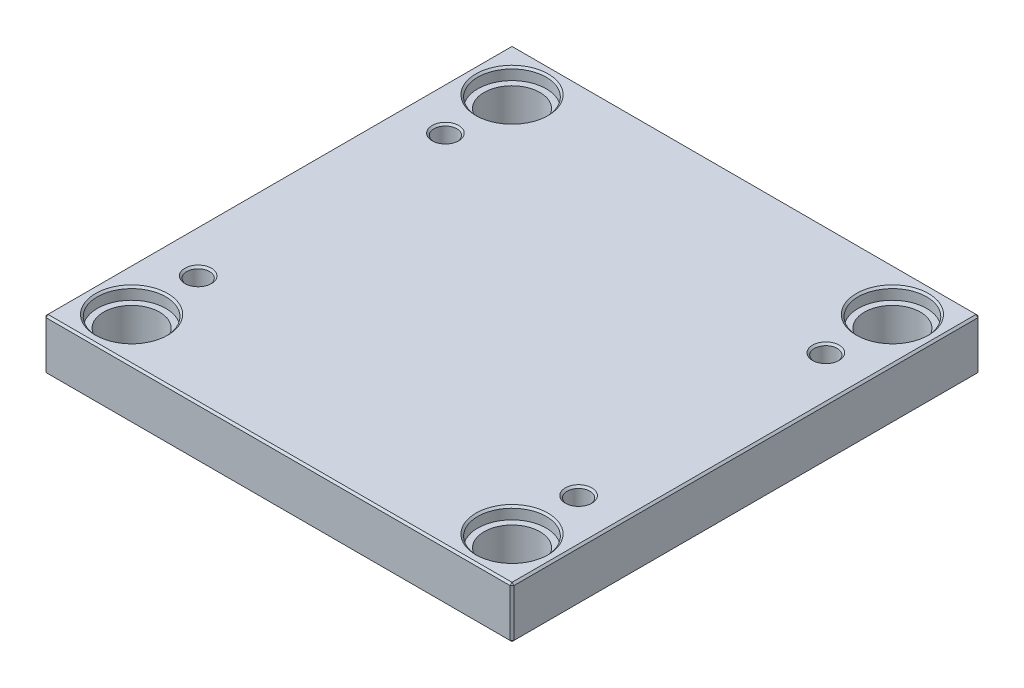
ISO-10303-21;
HEADER;
FILE_DESCRIPTION(('STEP AP214'),'2;1');
FILE_NAME('part.step','',(''),(''),'','','');
FILE_SCHEMA(('AUTOMOTIVE_DESIGN { 1 0 10303 214 1 1 1 1 }'));
ENDSEC;
DATA;
#1=APPLICATION_CONTEXT('core data for automotive mechanical design processes');
#2=APPLICATION_PROTOCOL_DEFINITION('international standard','automotive_design',2000,#1);
#3=PRODUCT_CONTEXT('',#1,'mechanical');
#4=PRODUCT('Part','Part','',(#3));
#5=PRODUCT_RELATED_PRODUCT_CATEGORY('part','',(#4));
#6=PRODUCT_DEFINITION_FORMATION('','',#4);
#7=PRODUCT_DEFINITION_CONTEXT('part definition',#1,'design');
#8=PRODUCT_DEFINITION('design','',#6,#7);
#9=PRODUCT_DEFINITION_SHAPE('','',#8);
#10=(LENGTH_UNIT() NAMED_UNIT(*) SI_UNIT(.MILLI.,.METRE.));
#11=(NAMED_UNIT(*) PLANE_ANGLE_UNIT() SI_UNIT($,.RADIAN.));
#12=(NAMED_UNIT(*) SI_UNIT($,.STERADIAN.) SOLID_ANGLE_UNIT());
#13=UNCERTAINTY_MEASURE_WITH_UNIT(LENGTH_MEASURE(1.E-05),#10,'distance_accuracy_value','');
#14=(GEOMETRIC_REPRESENTATION_CONTEXT(3) GLOBAL_UNCERTAINTY_ASSIGNED_CONTEXT((#13)) GLOBAL_UNIT_ASSIGNED_CONTEXT((#10,
#11,#12)) REPRESENTATION_CONTEXT('',''));
#15=CARTESIAN_POINT('',(0.,0.,0.));
#16=DIRECTION('',(0.,0.,1.));
#17=DIRECTION('',(1.,0.,0.));
#18=AXIS2_PLACEMENT_3D('',#15,#16,#17);
#19=CARTESIAN_POINT('',(-100.,0.,-100.));
#20=DIRECTION('',(0.,1.,0.));
#21=DIRECTION('',(0.,0.,1.));
#22=AXIS2_PLACEMENT_3D('',#19,#20,#21);
#23=CYLINDRICAL_SURFACE('',#22,14.7);
#24=CARTESIAN_POINT('',(-100.,1.00000000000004,-100.));
#25=DIRECTION('',(0.,1.,0.));
#26=DIRECTION('',(0.,0.,1.));
#27=AXIS2_PLACEMENT_3D('',#24,#25,#26);
#28=CIRCLE('',#27,14.7);
#29=CARTESIAN_POINT('',(-100.,1.00000000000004,-85.3));
#30=VERTEX_POINT('',#29);
#31=EDGE_CURVE('E471',#30,#30,#28,.F.);
#32=ORIENTED_EDGE('',*,*,#31,.T.);
#33=EDGE_LOOP('',(#32));
#34=FACE_BOUND('',#33,.T.);
#35=CARTESIAN_POINT('',(-100.,20.7,-100.));
#36=DIRECTION('',(0.,1.,0.));
#37=DIRECTION('',(0.,0.,1.));
#38=AXIS2_PLACEMENT_3D('',#35,#36,#37);
#39=CIRCLE('',#38,14.7);
#40=CARTESIAN_POINT('',(-100.,20.7,-85.3));
#41=VERTEX_POINT('',#40);
#42=EDGE_CURVE('E220',#41,#41,#39,.F.);
#43=ORIENTED_EDGE('',*,*,#42,.F.);
#44=EDGE_LOOP('',(#43));
#45=FACE_BOUND('',#44,.T.);
#46=ADVANCED_FACE('F15',(#34,#45),#23,.F.);
#47=CARTESIAN_POINT('',(100.,0.,-100.));
#48=DIRECTION('',(0.,1.,0.));
#49=DIRECTION('',(0.,0.,1.));
#50=AXIS2_PLACEMENT_3D('',#47,#48,#49);
#51=CYLINDRICAL_SURFACE('',#50,14.7);
#52=CARTESIAN_POINT('',(100.,1.00000000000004,-100.));
#53=DIRECTION('',(0.,1.,0.));
#54=DIRECTION('',(0.,0.,1.));
#55=AXIS2_PLACEMENT_3D('',#52,#53,#54);
#56=CIRCLE('',#55,14.7);
#57=CARTESIAN_POINT('',(100.,1.00000000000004,-85.3));
#58=VERTEX_POINT('',#57);
#59=EDGE_CURVE('E473',#58,#58,#56,.F.);
#60=ORIENTED_EDGE('',*,*,#59,.T.);
#61=EDGE_LOOP('',(#60));
#62=FACE_BOUND('',#61,.T.);
#63=CARTESIAN_POINT('',(100.,20.7,-100.));
#64=DIRECTION('',(0.,1.,0.));
#65=DIRECTION('',(0.,0.,1.));
#66=AXIS2_PLACEMENT_3D('',#63,#64,#65);
#67=CIRCLE('',#66,14.7);
#68=CARTESIAN_POINT('',(100.,20.7,-85.3));
#69=VERTEX_POINT('',#68);
#70=EDGE_CURVE('E217',#69,#69,#67,.F.);
#71=ORIENTED_EDGE('',*,*,#70,.F.);
#72=EDGE_LOOP('',(#71));
#73=FACE_BOUND('',#72,.T.);
#74=ADVANCED_FACE('F262',(#62,#73),#51,.F.);
#75=CARTESIAN_POINT('',(100.,0.,100.));
#76=DIRECTION('',(0.,1.,0.));
#77=DIRECTION('',(0.,0.,1.));
#78=AXIS2_PLACEMENT_3D('',#75,#76,#77);
#79=CYLINDRICAL_SURFACE('',#78,14.7);
#80=CARTESIAN_POINT('',(100.,0.999999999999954,100.));
#81=DIRECTION('',(0.,1.,0.));
#82=DIRECTION('',(0.,0.,1.));
#83=AXIS2_PLACEMENT_3D('',#80,#81,#82);
#84=CIRCLE('',#83,14.7);
#85=CARTESIAN_POINT('',(100.,0.999999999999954,114.7));
#86=VERTEX_POINT('',#85);
#87=EDGE_CURVE('E476',#86,#86,#84,.F.);
#88=ORIENTED_EDGE('',*,*,#87,.T.);
#89=EDGE_LOOP('',(#88));
#90=FACE_BOUND('',#89,.T.);
#91=CARTESIAN_POINT('',(100.,20.7,100.));
#92=DIRECTION('',(0.,1.,0.));
#93=DIRECTION('',(0.,0.,1.));
#94=AXIS2_PLACEMENT_3D('',#91,#92,#93);
#95=CIRCLE('',#94,14.7);
#96=CARTESIAN_POINT('',(100.,20.7,114.7));
#97=VERTEX_POINT('',#96);
#98=EDGE_CURVE('E213',#97,#97,#95,.F.);
#99=ORIENTED_EDGE('',*,*,#98,.F.);
#100=EDGE_LOOP('',(#99));
#101=FACE_BOUND('',#100,.T.);
#102=ADVANCED_FACE('F269',(#90,#101),#79,.F.);
#103=CARTESIAN_POINT('',(-100.,0.,100.));
#104=DIRECTION('',(0.,1.,0.));
#105=DIRECTION('',(0.,0.,1.));
#106=AXIS2_PLACEMENT_3D('',#103,#104,#105);
#107=CYLINDRICAL_SURFACE('',#106,14.7);
#108=CARTESIAN_POINT('',(-100.,1.00000000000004,100.));
#109=DIRECTION('',(0.,1.,0.));
#110=DIRECTION('',(0.,0.,1.));
#111=AXIS2_PLACEMENT_3D('',#108,#109,#110);
#112=CIRCLE('',#111,14.7);
#113=CARTESIAN_POINT('',(-100.,1.00000000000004,114.7));
#114=VERTEX_POINT('',#113);
#115=EDGE_CURVE('E479',#114,#114,#112,.F.);
#116=ORIENTED_EDGE('',*,*,#115,.T.);
#117=EDGE_LOOP('',(#116));
#118=FACE_BOUND('',#117,.T.);
#119=CARTESIAN_POINT('',(-100.,20.7,100.));
#120=DIRECTION('',(0.,1.,0.));
#121=DIRECTION('',(0.,0.,1.));
#122=AXIS2_PLACEMENT_3D('',#119,#120,#121);
#123=CIRCLE('',#122,14.7);
#124=CARTESIAN_POINT('',(-100.,20.7,114.7));
#125=VERTEX_POINT('',#124);
#126=EDGE_CURVE('E210',#125,#125,#123,.F.);
#127=ORIENTED_EDGE('',*,*,#126,.F.);
#128=EDGE_LOOP('',(#127));
#129=FACE_BOUND('',#128,.T.);
#130=ADVANCED_FACE('F276',(#118,#129),#107,.F.);
#131=CARTESIAN_POINT('',(-123.,27.,123.));
#132=DIRECTION('',(1.,0.,0.));
#133=DIRECTION('',(0.,0.,-1.));
#134=AXIS2_PLACEMENT_3D('',#131,#132,#133);
#135=PLANE('',#134);
#136=DIRECTION('',(0.,-1.,0.));
#137=VECTOR('',#136,1.);
#138=CARTESIAN_POINT('',(-123.,27.,-122.));
#139=LINE('',#138,#137);
#140=CARTESIAN_POINT('',(-123.,26.,-122.));
#141=VERTEX_POINT('',#140);
#142=CARTESIAN_POINT('',(-123.,0.999999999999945,-122.));
#143=VERTEX_POINT('',#142);
#144=EDGE_CURVE('E486',#141,#143,#139,.T.);
#145=ORIENTED_EDGE('',*,*,#144,.T.);
#146=DIRECTION('',(0.,0.,1.));
#147=VECTOR('',#146,1.);
#148=CARTESIAN_POINT('',(-123.,0.999999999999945,123.));
#149=LINE('',#148,#147);
#150=CARTESIAN_POINT('',(-123.,0.999999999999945,122.));
#151=VERTEX_POINT('',#150);
#152=EDGE_CURVE('E489',#143,#151,#149,.T.);
#153=ORIENTED_EDGE('',*,*,#152,.T.);
#154=DIRECTION('',(0.,1.,0.));
#155=VECTOR('',#154,1.);
#156=CARTESIAN_POINT('',(-123.,27.,122.));
#157=LINE('',#156,#155);
#158=CARTESIAN_POINT('',(-123.,26.,122.));
#159=VERTEX_POINT('',#158);
#160=EDGE_CURVE('E484',#151,#159,#157,.T.);
#161=ORIENTED_EDGE('',*,*,#160,.T.);
#162=DIRECTION('',(0.,0.,-1.));
#163=VECTOR('',#162,1.);
#164=CARTESIAN_POINT('',(-123.,26.,-123.));
#165=LINE('',#164,#163);
#166=EDGE_CURVE('E482',#159,#141,#165,.T.);
#167=ORIENTED_EDGE('',*,*,#166,.T.);
#168=EDGE_LOOP('',(#145,#153,#161,#167));
#169=FACE_BOUND('',#168,.T.);
#170=ADVANCED_FACE('F297',(#169),#135,.F.);
#171=CARTESIAN_POINT('',(123.,27.,123.));
#172=DIRECTION('',(0.,0.,-1.));
#173=DIRECTION('',(-1.,0.,0.));
#174=AXIS2_PLACEMENT_3D('',#171,#172,#173);
#175=PLANE('',#174);
#176=DIRECTION('',(-1.,0.,0.));
#177=VECTOR('',#176,1.);
#178=CARTESIAN_POINT('',(-123.,26.,123.));
#179=LINE('',#178,#177);
#180=CARTESIAN_POINT('',(122.,26.,123.));
#181=VERTEX_POINT('',#180);
#182=CARTESIAN_POINT('',(-122.,26.,123.));
#183=VERTEX_POINT('',#182);
#184=EDGE_CURVE('E508',#181,#183,#179,.T.);
#185=ORIENTED_EDGE('',*,*,#184,.T.);
#186=DIRECTION('',(0.,-1.,0.));
#187=VECTOR('',#186,1.);
#188=CARTESIAN_POINT('',(-122.,27.,123.));
#189=LINE('',#188,#187);
#190=CARTESIAN_POINT('',(-122.,0.999999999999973,123.));
#191=VERTEX_POINT('',#190);
#192=EDGE_CURVE('E514',#183,#191,#189,.T.);
#193=ORIENTED_EDGE('',*,*,#192,.T.);
#194=DIRECTION('',(1.,0.,0.));
#195=VECTOR('',#194,1.);
#196=CARTESIAN_POINT('',(123.,0.999999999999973,123.));
#197=LINE('',#196,#195);
#198=CARTESIAN_POINT('',(122.,0.999999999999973,123.));
#199=VERTEX_POINT('',#198);
#200=EDGE_CURVE('E512',#191,#199,#197,.T.);
#201=ORIENTED_EDGE('',*,*,#200,.T.);
#202=DIRECTION('',(0.,1.,0.));
#203=VECTOR('',#202,1.);
#204=CARTESIAN_POINT('',(122.,27.,123.));
#205=LINE('',#204,#203);
#206=EDGE_CURVE('E510',#199,#181,#205,.T.);
#207=ORIENTED_EDGE('',*,*,#206,.T.);
#208=EDGE_LOOP('',(#185,#193,#201,#207));
#209=FACE_BOUND('',#208,.T.);
#210=ADVANCED_FACE('F293',(#209),#175,.F.);
#211=CARTESIAN_POINT('',(123.,27.,123.));
#212=DIRECTION('',(-1.,0.,0.));
#213=DIRECTION('',(0.,0.,1.));
#214=AXIS2_PLACEMENT_3D('',#211,#212,#213);
#215=PLANE('',#214);
#216=DIRECTION('',(0.,0.,-1.));
#217=VECTOR('',#216,1.);
#218=CARTESIAN_POINT('',(123.,0.999999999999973,123.));
#219=LINE('',#218,#217);
#220=CARTESIAN_POINT('',(123.,0.999999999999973,122.));
#221=VERTEX_POINT('',#220);
#222=CARTESIAN_POINT('',(123.,0.999999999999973,-122.));
#223=VERTEX_POINT('',#222);
#224=EDGE_CURVE('E503',#221,#223,#219,.T.);
#225=ORIENTED_EDGE('',*,*,#224,.T.);
#226=DIRECTION('',(0.,1.,0.));
#227=VECTOR('',#226,1.);
#228=CARTESIAN_POINT('',(123.,27.,-122.));
#229=LINE('',#228,#227);
#230=CARTESIAN_POINT('',(123.,26.,-122.));
#231=VERTEX_POINT('',#230);
#232=EDGE_CURVE('E505',#223,#231,#229,.T.);
#233=ORIENTED_EDGE('',*,*,#232,.T.);
#234=DIRECTION('',(0.,0.,1.));
#235=VECTOR('',#234,1.);
#236=CARTESIAN_POINT('',(123.,26.,123.));
#237=LINE('',#236,#235);
#238=CARTESIAN_POINT('',(123.,26.,122.));
#239=VERTEX_POINT('',#238);
#240=EDGE_CURVE('E499',#231,#239,#237,.T.);
#241=ORIENTED_EDGE('',*,*,#240,.T.);
#242=DIRECTION('',(0.,-1.,0.));
#243=VECTOR('',#242,1.);
#244=CARTESIAN_POINT('',(123.,27.,122.));
#245=LINE('',#244,#243);
#246=EDGE_CURVE('E501',#239,#221,#245,.T.);
#247=ORIENTED_EDGE('',*,*,#246,.T.);
#248=EDGE_LOOP('',(#225,#233,#241,#247));
#249=FACE_BOUND('',#248,.T.);
#250=ADVANCED_FACE('F289',(#249),#215,.F.);
#251=CARTESIAN_POINT('',(123.,27.,-123.));
#252=DIRECTION('',(0.,0.,1.));
#253=DIRECTION('',(1.,0.,0.));
#254=AXIS2_PLACEMENT_3D('',#251,#252,#253);
#255=PLANE('',#254);
#256=DIRECTION('',(0.,-1.,0.));
#257=VECTOR('',#256,1.);
#258=CARTESIAN_POINT('',(122.,27.,-123.));
#259=LINE('',#258,#257);
#260=CARTESIAN_POINT('',(122.,26.,-123.));
#261=VERTEX_POINT('',#260);
#262=CARTESIAN_POINT('',(122.,0.999999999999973,-123.));
#263=VERTEX_POINT('',#262);
#264=EDGE_CURVE('E493',#261,#263,#259,.T.);
#265=ORIENTED_EDGE('',*,*,#264,.T.);
#266=DIRECTION('',(-1.,0.,0.));
#267=VECTOR('',#266,1.);
#268=CARTESIAN_POINT('',(123.,0.999999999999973,-123.));
#269=LINE('',#268,#267);
#270=CARTESIAN_POINT('',(-122.,0.999999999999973,-123.));
#271=VERTEX_POINT('',#270);
#272=EDGE_CURVE('E137',#263,#271,#269,.T.);
#273=ORIENTED_EDGE('',*,*,#272,.T.);
#274=DIRECTION('',(0.,1.,0.));
#275=VECTOR('',#274,1.);
#276=CARTESIAN_POINT('',(-122.,27.,-123.));
#277=LINE('',#276,#275);
#278=CARTESIAN_POINT('',(-122.,26.,-123.));
#279=VERTEX_POINT('',#278);
#280=EDGE_CURVE('E495',#271,#279,#277,.T.);
#281=ORIENTED_EDGE('',*,*,#280,.T.);
#282=DIRECTION('',(1.,0.,0.));
#283=VECTOR('',#282,1.);
#284=CARTESIAN_POINT('',(123.,26.,-123.));
#285=LINE('',#284,#283);
#286=EDGE_CURVE('E491',#279,#261,#285,.T.);
#287=ORIENTED_EDGE('',*,*,#286,.T.);
#288=EDGE_LOOP('',(#265,#273,#281,#287));
#289=FACE_BOUND('',#288,.T.);
#290=ADVANCED_FACE('F281',(#289),#255,.F.);
#291=CARTESIAN_POINT('',(0.,27.,0.));
#292=DIRECTION('',(0.,1.,0.));
#293=DIRECTION('',(0.,0.,1.));
#294=AXIS2_PLACEMENT_3D('',#291,#292,#293);
#295=PLANE('',#294);
#296=CARTESIAN_POINT('',(100.,27.,100.));
#297=DIRECTION('',(0.,1.,0.));
#298=DIRECTION('',(0.,0.,1.));
#299=AXIS2_PLACEMENT_3D('',#296,#297,#298);
#300=CIRCLE('',#299,19.);
#301=CARTESIAN_POINT('',(100.,27.,119.));
#302=VERTEX_POINT('',#301);
#303=EDGE_CURVE('E235',#302,#302,#300,.F.);
#304=ORIENTED_EDGE('',*,*,#303,.T.);
#305=EDGE_LOOP('',(#304));
#306=FACE_BOUND('',#305,.T.);
#307=CARTESIAN_POINT('',(-100.,27.,100.));
#308=DIRECTION('',(0.,1.,0.));
#309=DIRECTION('',(0.,0.,1.));
#310=AXIS2_PLACEMENT_3D('',#307,#308,#309);
#311=CIRCLE('',#310,19.);
#312=CARTESIAN_POINT('',(-100.,27.,119.));
#313=VERTEX_POINT('',#312);
#314=EDGE_CURVE('E232',#313,#313,#311,.F.);
#315=ORIENTED_EDGE('',*,*,#314,.T.);
#316=EDGE_LOOP('',(#315));
#317=FACE_BOUND('',#316,.T.);
#318=CARTESIAN_POINT('',(100.,27.,-100.));
#319=DIRECTION('',(0.,1.,0.));
#320=DIRECTION('',(0.,0.,1.));
#321=AXIS2_PLACEMENT_3D('',#318,#319,#320);
#322=CIRCLE('',#321,19.);
#323=CARTESIAN_POINT('',(100.,27.,-81.));
#324=VERTEX_POINT('',#323);
#325=EDGE_CURVE('E229',#324,#324,#322,.F.);
#326=ORIENTED_EDGE('',*,*,#325,.T.);
#327=EDGE_LOOP('',(#326));
#328=FACE_BOUND('',#327,.T.);
#329=CARTESIAN_POINT('',(-100.,27.,-100.));
#330=DIRECTION('',(0.,1.,0.));
#331=DIRECTION('',(0.,0.,1.));
#332=AXIS2_PLACEMENT_3D('',#329,#330,#331);
#333=CIRCLE('',#332,19.);
#334=CARTESIAN_POINT('',(-100.,27.,-81.));
#335=VERTEX_POINT('',#334);
#336=EDGE_CURVE('E226',#335,#335,#333,.F.);
#337=ORIENTED_EDGE('',*,*,#336,.T.);
#338=EDGE_LOOP('',(#337));
#339=FACE_BOUND('',#338,.T.);
#340=CARTESIAN_POINT('',(-100.,27.,65.));
#341=DIRECTION('',(0.,1.,0.));
#342=DIRECTION('',(0.,0.,1.));
#343=AXIS2_PLACEMENT_3D('',#340,#341,#342);
#344=CIRCLE('',#343,7.);
#345=CARTESIAN_POINT('',(-100.,27.,72.));
#346=VERTEX_POINT('',#345);
#347=EDGE_CURVE('E197',#346,#346,#344,.F.);
#348=ORIENTED_EDGE('',*,*,#347,.T.);
#349=EDGE_LOOP('',(#348));
#350=FACE_BOUND('',#349,.T.);
#351=CARTESIAN_POINT('',(100.,27.,65.));
#352=DIRECTION('',(0.,1.,0.));
#353=DIRECTION('',(0.,0.,1.));
#354=AXIS2_PLACEMENT_3D('',#351,#352,#353);
#355=CIRCLE('',#354,7.);
#356=CARTESIAN_POINT('',(100.,27.,72.));
#357=VERTEX_POINT('',#356);
#358=EDGE_CURVE('E194',#357,#357,#355,.F.);
#359=ORIENTED_EDGE('',*,*,#358,.T.);
#360=EDGE_LOOP('',(#359));
#361=FACE_BOUND('',#360,.T.);
#362=CARTESIAN_POINT('',(100.,27.,-65.));
#363=DIRECTION('',(0.,1.,0.));
#364=DIRECTION('',(0.,0.,1.));
#365=AXIS2_PLACEMENT_3D('',#362,#363,#364);
#366=CIRCLE('',#365,7.);
#367=CARTESIAN_POINT('',(100.,27.,-58.));
#368=VERTEX_POINT('',#367);
#369=EDGE_CURVE('E191',#368,#368,#366,.F.);
#370=ORIENTED_EDGE('',*,*,#369,.T.);
#371=EDGE_LOOP('',(#370));
#372=FACE_BOUND('',#371,.T.);
#373=CARTESIAN_POINT('',(-100.,27.,-65.));
#374=DIRECTION('',(0.,1.,0.));
#375=DIRECTION('',(0.,0.,1.));
#376=AXIS2_PLACEMENT_3D('',#373,#374,#375);
#377=CIRCLE('',#376,7.);
#378=CARTESIAN_POINT('',(-100.,27.,-58.));
#379=VERTEX_POINT('',#378);
#380=EDGE_CURVE('E187',#379,#379,#377,.F.);
#381=ORIENTED_EDGE('',*,*,#380,.T.);
#382=EDGE_LOOP('',(#381));
#383=FACE_BOUND('',#382,.T.);
#384=DIRECTION('',(0.,0.,-1.));
#385=VECTOR('',#384,1.);
#386=CARTESIAN_POINT('',(122.,27.,-123.));
#387=LINE('',#386,#385);
#388=CARTESIAN_POINT('',(122.,27.,122.));
#389=VERTEX_POINT('',#388);
#390=CARTESIAN_POINT('',(122.,27.,-122.));
#391=VERTEX_POINT('',#390);
#392=EDGE_CURVE('E30',#389,#391,#387,.T.);
#393=ORIENTED_EDGE('',*,*,#392,.T.);
#394=DIRECTION('',(-1.,0.,0.));
#395=VECTOR('',#394,1.);
#396=CARTESIAN_POINT('',(-123.,27.,-122.));
#397=LINE('',#396,#395);
#398=CARTESIAN_POINT('',(-122.,27.,-122.));
#399=VERTEX_POINT('',#398);
#400=EDGE_CURVE('E188',#391,#399,#397,.T.);
#401=ORIENTED_EDGE('',*,*,#400,.T.);
#402=DIRECTION('',(0.,0.,1.));
#403=VECTOR('',#402,1.);
#404=CARTESIAN_POINT('',(-122.,27.,123.));
#405=LINE('',#404,#403);
#406=CARTESIAN_POINT('',(-122.,27.,122.));
#407=VERTEX_POINT('',#406);
#408=EDGE_CURVE('E517',#399,#407,#405,.T.);
#409=ORIENTED_EDGE('',*,*,#408,.T.);
#410=DIRECTION('',(1.,0.,0.));
#411=VECTOR('',#410,1.);
#412=CARTESIAN_POINT('',(123.,27.,122.));
#413=LINE('',#412,#411);
#414=EDGE_CURVE('E35',#407,#389,#413,.T.);
#415=ORIENTED_EDGE('',*,*,#414,.T.);
#416=EDGE_LOOP('',(#393,#401,#409,#415));
#417=FACE_BOUND('',#416,.T.);
#418=ADVANCED_FACE('F278',(#306,#317,#328,#339,#350,#361,#372,#383,#417),#295,.T.);
#419=CARTESIAN_POINT('',(0.,0.,0.));
#420=DIRECTION('',(0.,1.,0.));
#421=DIRECTION('',(0.,0.,1.));
#422=AXIS2_PLACEMENT_3D('',#419,#420,#421);
#423=PLANE('',#422);
#424=CARTESIAN_POINT('',(-100.,0.,-100.));
#425=DIRECTION('',(0.,1.,0.));
#426=DIRECTION('',(0.,0.,1.));
#427=AXIS2_PLACEMENT_3D('',#424,#425,#426);
#428=CIRCLE('',#427,15.7);
#429=CARTESIAN_POINT('',(-100.,0.,-84.3));
#430=VERTEX_POINT('',#429);
#431=EDGE_CURVE('E468',#430,#430,#428,.T.);
#432=ORIENTED_EDGE('',*,*,#431,.T.);
#433=EDGE_LOOP('',(#432));
#434=FACE_BOUND('',#433,.T.);
#435=CARTESIAN_POINT('',(100.,0.,-100.));
#436=DIRECTION('',(0.,1.,0.));
#437=DIRECTION('',(0.,0.,1.));
#438=AXIS2_PLACEMENT_3D('',#435,#436,#437);
#439=CIRCLE('',#438,15.7);
#440=CARTESIAN_POINT('',(100.,0.,-84.3));
#441=VERTEX_POINT('',#440);
#442=EDGE_CURVE('E465',#441,#441,#439,.T.);
#443=ORIENTED_EDGE('',*,*,#442,.T.);
#444=EDGE_LOOP('',(#443));
#445=FACE_BOUND('',#444,.T.);
#446=CARTESIAN_POINT('',(100.,0.,100.));
#447=DIRECTION('',(0.,1.,0.));
#448=DIRECTION('',(0.,0.,1.));
#449=AXIS2_PLACEMENT_3D('',#446,#447,#448);
#450=CIRCLE('',#449,15.7);
#451=CARTESIAN_POINT('',(100.,0.,115.7));
#452=VERTEX_POINT('',#451);
#453=EDGE_CURVE('E462',#452,#452,#450,.T.);
#454=ORIENTED_EDGE('',*,*,#453,.T.);
#455=EDGE_LOOP('',(#454));
#456=FACE_BOUND('',#455,.T.);
#457=CARTESIAN_POINT('',(-100.,0.,100.));
#458=DIRECTION('',(0.,1.,0.));
#459=DIRECTION('',(0.,0.,1.));
#460=AXIS2_PLACEMENT_3D('',#457,#458,#459);
#461=CIRCLE('',#460,15.7);
#462=CARTESIAN_POINT('',(-100.,0.,115.7));
#463=VERTEX_POINT('',#462);
#464=EDGE_CURVE('E459',#463,#463,#461,.T.);
#465=ORIENTED_EDGE('',*,*,#464,.T.);
#466=EDGE_LOOP('',(#465));
#467=FACE_BOUND('',#466,.T.);
#468=DIRECTION('',(0.,0.,1.));
#469=VECTOR('',#468,1.);
#470=CARTESIAN_POINT('',(122.,0.,0.));
#471=LINE('',#470,#469);
#472=CARTESIAN_POINT('',(122.,0.,-122.));
#473=VERTEX_POINT('',#472);
#474=CARTESIAN_POINT('',(122.,0.,122.));
#475=VERTEX_POINT('',#474);
#476=EDGE_CURVE('E107',#473,#475,#471,.T.);
#477=ORIENTED_EDGE('',*,*,#476,.T.);
#478=DIRECTION('',(-1.,0.,0.));
#479=VECTOR('',#478,1.);
#480=CARTESIAN_POINT('',(0.,0.,122.));
#481=LINE('',#480,#479);
#482=CARTESIAN_POINT('',(-122.,0.,122.));
#483=VERTEX_POINT('',#482);
#484=EDGE_CURVE('E457',#475,#483,#481,.T.);
#485=ORIENTED_EDGE('',*,*,#484,.T.);
#486=DIRECTION('',(0.,0.,-1.));
#487=VECTOR('',#486,1.);
#488=CARTESIAN_POINT('',(-122.,0.,0.));
#489=LINE('',#488,#487);
#490=CARTESIAN_POINT('',(-122.,0.,-122.));
#491=VERTEX_POINT('',#490);
#492=EDGE_CURVE('E109',#483,#491,#489,.T.);
#493=ORIENTED_EDGE('',*,*,#492,.T.);
#494=DIRECTION('',(1.,0.,0.));
#495=VECTOR('',#494,1.);
#496=CARTESIAN_POINT('',(0.,0.,-122.));
#497=LINE('',#496,#495);
#498=EDGE_CURVE('E103',#491,#473,#497,.T.);
#499=ORIENTED_EDGE('',*,*,#498,.T.);
#500=EDGE_LOOP('',(#477,#485,#493,#499));
#501=FACE_BOUND('',#500,.T.);
#502=ADVANCED_FACE('F105',(#434,#445,#456,#467,#501),#423,.F.);
#503=CARTESIAN_POINT('',(-100.,0.,-100.));
#504=DIRECTION('',(0.,-1.,0.));
#505=DIRECTION('',(0.,0.,-1.));
#506=AXIS2_PLACEMENT_3D('',#503,#504,#505);
#507=CONICAL_SURFACE('',#506,15.7,0.785398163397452);
#508=ORIENTED_EDGE('',*,*,#31,.F.);
#509=EDGE_LOOP('',(#508));
#510=FACE_BOUND('',#509,.T.);
#511=ORIENTED_EDGE('',*,*,#431,.F.);
#512=EDGE_LOOP('',(#511));
#513=FACE_BOUND('',#512,.T.);
#514=ADVANCED_FACE('F285',(#510,#513),#507,.F.);
#515=CARTESIAN_POINT('',(100.,0.,-100.));
#516=DIRECTION('',(0.,-1.,0.));
#517=DIRECTION('',(0.,0.,-1.));
#518=AXIS2_PLACEMENT_3D('',#515,#516,#517);
#519=CONICAL_SURFACE('',#518,15.7,0.785398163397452);
#520=ORIENTED_EDGE('',*,*,#59,.F.);
#521=EDGE_LOOP('',(#520));
#522=FACE_BOUND('',#521,.T.);
#523=ORIENTED_EDGE('',*,*,#442,.F.);
#524=EDGE_LOOP('',(#523));
#525=FACE_BOUND('',#524,.T.);
#526=ADVANCED_FACE('F304',(#522,#525),#519,.F.);
#527=CARTESIAN_POINT('',(100.,0.,100.));
#528=DIRECTION('',(0.,-1.,0.));
#529=DIRECTION('',(0.,0.,-1.));
#530=AXIS2_PLACEMENT_3D('',#527,#528,#529);
#531=CONICAL_SURFACE('',#530,15.7,0.785398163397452);
#532=ORIENTED_EDGE('',*,*,#87,.F.);
#533=EDGE_LOOP('',(#532));
#534=FACE_BOUND('',#533,.T.);
#535=ORIENTED_EDGE('',*,*,#453,.F.);
#536=EDGE_LOOP('',(#535));
#537=FACE_BOUND('',#536,.T.);
#538=ADVANCED_FACE('F308',(#534,#537),#531,.F.);
#539=CARTESIAN_POINT('',(-100.,0.,100.));
#540=DIRECTION('',(0.,-1.,0.));
#541=DIRECTION('',(0.,0.,-1.));
#542=AXIS2_PLACEMENT_3D('',#539,#540,#541);
#543=CONICAL_SURFACE('',#542,15.7,0.785398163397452);
#544=ORIENTED_EDGE('',*,*,#115,.F.);
#545=EDGE_LOOP('',(#544));
#546=FACE_BOUND('',#545,.T.);
#547=ORIENTED_EDGE('',*,*,#464,.F.);
#548=EDGE_LOOP('',(#547));
#549=FACE_BOUND('',#548,.T.);
#550=ADVANCED_FACE('F312',(#546,#549),#543,.F.);
#551=CARTESIAN_POINT('',(123.,27.,122.));
#552=DIRECTION('',(-0.707106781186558,0.,-0.707106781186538));
#553=DIRECTION('',(0.,-1.,0.));
#554=AXIS2_PLACEMENT_3D('',#551,#552,#553);
#555=PLANE('',#554);
#556=DIRECTION('',(-0.707106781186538,0.,0.707106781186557));
#557=VECTOR('',#556,1.);
#558=CARTESIAN_POINT('',(122.,26.,123.));
#559=LINE('',#558,#557);
#560=EDGE_CURVE('E125',#181,#239,#559,.F.);
#561=ORIENTED_EDGE('',*,*,#560,.F.);
#562=ORIENTED_EDGE('',*,*,#206,.F.);
#563=DIRECTION('',(0.707106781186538,0.,-0.707106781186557));
#564=VECTOR('',#563,1.);
#565=CARTESIAN_POINT('',(122.,0.999999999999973,123.));
#566=LINE('',#565,#564);
#567=EDGE_CURVE('E179',#221,#199,#566,.F.);
#568=ORIENTED_EDGE('',*,*,#567,.F.);
#569=ORIENTED_EDGE('',*,*,#246,.F.);
#570=EDGE_LOOP('',(#561,#562,#568,#569));
#571=FACE_BOUND('',#570,.T.);
#572=ADVANCED_FACE('F316',(#571),#555,.F.);
#573=CARTESIAN_POINT('',(122.,26.,123.));
#574=DIRECTION('',(0.577350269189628,0.577350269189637,0.577350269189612));
#575=DIRECTION('',(-0.707106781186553,0.707106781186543,0.));
#576=AXIS2_PLACEMENT_3D('',#573,#574,#575);
#577=PLANE('',#576);
#578=DIRECTION('',(0.,-0.70710678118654,0.707106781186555));
#579=VECTOR('',#578,1.);
#580=CARTESIAN_POINT('',(122.,26.,123.));
#581=LINE('',#580,#579);
#582=EDGE_CURVE('E174',#181,#389,#581,.F.);
#583=ORIENTED_EDGE('',*,*,#582,.F.);
#584=ORIENTED_EDGE('',*,*,#560,.T.);
#585=DIRECTION('',(-0.707106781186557,0.707106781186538,0.));
#586=VECTOR('',#585,1.);
#587=CARTESIAN_POINT('',(122.5,26.5,122.));
#588=LINE('',#587,#586);
#589=EDGE_CURVE('E176',#389,#239,#588,.F.);
#590=ORIENTED_EDGE('',*,*,#589,.F.);
#591=EDGE_LOOP('',(#583,#584,#590));
#592=FACE_BOUND('',#591,.T.);
#593=ADVANCED_FACE('F384',(#592),#577,.T.);
#594=CARTESIAN_POINT('',(122.,0.999999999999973,123.));
#595=DIRECTION('',(0.577350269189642,-0.57735026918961,0.577350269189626));
#596=DIRECTION('',(0.707106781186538,0.,-0.707106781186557));
#597=AXIS2_PLACEMENT_3D('',#594,#595,#596);
#598=PLANE('',#597);
#599=DIRECTION('',(-0.707106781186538,-0.707106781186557,0.));
#600=VECTOR('',#599,1.);
#601=CARTESIAN_POINT('',(122.5,0.499999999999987,122.));
#602=LINE('',#601,#600);
#603=EDGE_CURVE('E123',#221,#475,#602,.T.);
#604=ORIENTED_EDGE('',*,*,#603,.F.);
#605=ORIENTED_EDGE('',*,*,#567,.T.);
#606=DIRECTION('',(0.,0.70710678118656,0.707106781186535));
#607=VECTOR('',#606,1.);
#608=CARTESIAN_POINT('',(122.,0.999999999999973,123.));
#609=LINE('',#608,#607);
#610=EDGE_CURVE('E171',#475,#199,#609,.T.);
#611=ORIENTED_EDGE('',*,*,#610,.F.);
#612=EDGE_LOOP('',(#604,#605,#611));
#613=FACE_BOUND('',#612,.T.);
#614=ADVANCED_FACE('F380',(#613),#598,.T.);
#615=CARTESIAN_POINT('',(122.,27.,0.));
#616=DIRECTION('',(0.707106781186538,0.707106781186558,0.));
#617=DIRECTION('',(0.,0.,1.));
#618=AXIS2_PLACEMENT_3D('',#615,#616,#617);
#619=PLANE('',#618);
#620=ORIENTED_EDGE('',*,*,#589,.T.);
#621=ORIENTED_EDGE('',*,*,#240,.F.);
#622=DIRECTION('',(0.707106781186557,-0.707106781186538,0.));
#623=VECTOR('',#622,1.);
#624=CARTESIAN_POINT('',(123.,26.,-122.));
#625=LINE('',#624,#623);
#626=EDGE_CURVE('E165',#391,#231,#625,.T.);
#627=ORIENTED_EDGE('',*,*,#626,.F.);
#628=ORIENTED_EDGE('',*,*,#392,.F.);
#629=EDGE_LOOP('',(#620,#621,#627,#628));
#630=FACE_BOUND('',#629,.T.);
#631=ADVANCED_FACE('F376',(#630),#619,.T.);
#632=CARTESIAN_POINT('',(0.,27.,122.));
#633=DIRECTION('',(0.,0.707106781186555,0.70710678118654));
#634=DIRECTION('',(-1.,0.,0.));
#635=AXIS2_PLACEMENT_3D('',#632,#633,#634);
#636=PLANE('',#635);
#637=ORIENTED_EDGE('',*,*,#582,.T.);
#638=ORIENTED_EDGE('',*,*,#414,.F.);
#639=DIRECTION('',(0.,0.70710678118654,-0.707106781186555));
#640=VECTOR('',#639,1.);
#641=CARTESIAN_POINT('',(-122.,26.5,122.5));
#642=LINE('',#641,#640);
#643=EDGE_CURVE('E162',#183,#407,#642,.T.);
#644=ORIENTED_EDGE('',*,*,#643,.F.);
#645=ORIENTED_EDGE('',*,*,#184,.F.);
#646=EDGE_LOOP('',(#637,#638,#644,#645));
#647=FACE_BOUND('',#646,.T.);
#648=ADVANCED_FACE('F372',(#647),#636,.T.);
#649=CARTESIAN_POINT('',(-122.,27.,123.));
#650=DIRECTION('',(0.707106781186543,0.,-0.707106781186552));
#651=DIRECTION('',(0.,-1.,0.));
#652=AXIS2_PLACEMENT_3D('',#649,#650,#651);
#653=PLANE('',#652);
#654=DIRECTION('',(0.707106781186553,0.,0.707106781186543));
#655=VECTOR('',#654,1.);
#656=CARTESIAN_POINT('',(-122.,0.999999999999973,123.));
#657=LINE('',#656,#655);
#658=EDGE_CURVE('E156',#191,#151,#657,.F.);
#659=ORIENTED_EDGE('',*,*,#658,.F.);
#660=ORIENTED_EDGE('',*,*,#192,.F.);
#661=DIRECTION('',(-0.707106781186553,0.,-0.707106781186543));
#662=VECTOR('',#661,1.);
#663=CARTESIAN_POINT('',(-123.,26.,122.));
#664=LINE('',#663,#662);
#665=EDGE_CURVE('E159',#159,#183,#664,.F.);
#666=ORIENTED_EDGE('',*,*,#665,.F.);
#667=ORIENTED_EDGE('',*,*,#160,.F.);
#668=EDGE_LOOP('',(#659,#660,#666,#667));
#669=FACE_BOUND('',#668,.T.);
#670=ADVANCED_FACE('F368',(#669),#653,.F.);
#671=CARTESIAN_POINT('',(123.,0.999999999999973,123.));
#672=DIRECTION('',(0.,0.707106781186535,-0.70710678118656));
#673=DIRECTION('',(1.,0.,0.));
#674=AXIS2_PLACEMENT_3D('',#671,#672,#673);
#675=PLANE('',#674);
#676=ORIENTED_EDGE('',*,*,#610,.T.);
#677=ORIENTED_EDGE('',*,*,#200,.F.);
#678=DIRECTION('',(0.,-0.70710678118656,-0.707106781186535));
#679=VECTOR('',#678,1.);
#680=CARTESIAN_POINT('',(-122.,0.999999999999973,123.));
#681=LINE('',#680,#679);
#682=EDGE_CURVE('E134',#483,#191,#681,.F.);
#683=ORIENTED_EDGE('',*,*,#682,.F.);
#684=ORIENTED_EDGE('',*,*,#484,.F.);
#685=EDGE_LOOP('',(#676,#677,#683,#684));
#686=FACE_BOUND('',#685,.T.);
#687=ADVANCED_FACE('F365',(#686),#675,.F.);
#688=CARTESIAN_POINT('',(123.,0.999999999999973,123.));
#689=DIRECTION('',(-0.707106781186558,0.707106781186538,0.));
#690=DIRECTION('',(0.,0.,-1.));
#691=AXIS2_PLACEMENT_3D('',#688,#689,#690);
#692=PLANE('',#691);
#693=ORIENTED_EDGE('',*,*,#603,.T.);
#694=ORIENTED_EDGE('',*,*,#476,.F.);
#695=DIRECTION('',(0.707106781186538,0.707106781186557,0.));
#696=VECTOR('',#695,1.);
#697=CARTESIAN_POINT('',(122.5,0.499999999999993,-122.));
#698=LINE('',#697,#696);
#699=EDGE_CURVE('E120',#223,#473,#698,.F.);
#700=ORIENTED_EDGE('',*,*,#699,.F.);
#701=ORIENTED_EDGE('',*,*,#224,.F.);
#702=EDGE_LOOP('',(#693,#694,#700,#701));
#703=FACE_BOUND('',#702,.T.);
#704=ADVANCED_FACE('F118',(#703),#692,.F.);
#705=CARTESIAN_POINT('',(122.,27.,-123.));
#706=DIRECTION('',(-0.707106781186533,0.,0.707106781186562));
#707=DIRECTION('',(0.,-1.,0.));
#708=AXIS2_PLACEMENT_3D('',#705,#706,#707);
#709=PLANE('',#708);
#710=DIRECTION('',(0.707106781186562,0.,0.707106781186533));
#711=VECTOR('',#710,1.);
#712=CARTESIAN_POINT('',(123.,26.,-122.));
#713=LINE('',#712,#711);
#714=EDGE_CURVE('E167',#231,#261,#713,.F.);
#715=ORIENTED_EDGE('',*,*,#714,.F.);
#716=ORIENTED_EDGE('',*,*,#232,.F.);
#717=DIRECTION('',(-0.707106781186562,0.,-0.707106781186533));
#718=VECTOR('',#717,1.);
#719=CARTESIAN_POINT('',(122.,0.999999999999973,-123.));
#720=LINE('',#719,#718);
#721=EDGE_CURVE('E133',#263,#223,#720,.F.);
#722=ORIENTED_EDGE('',*,*,#721,.F.);
#723=ORIENTED_EDGE('',*,*,#264,.F.);
#724=EDGE_LOOP('',(#715,#716,#722,#723));
#725=FACE_BOUND('',#724,.T.);
#726=ADVANCED_FACE('F358',(#725),#709,.F.);
#727=CARTESIAN_POINT('',(123.,26.,-122.));
#728=DIRECTION('',(0.577350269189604,0.577350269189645,-0.577350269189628));
#729=DIRECTION('',(0.,0.707106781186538,0.707106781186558));
#730=AXIS2_PLACEMENT_3D('',#727,#728,#729);
#731=PLANE('',#730);
#732=ORIENTED_EDGE('',*,*,#626,.T.);
#733=ORIENTED_EDGE('',*,*,#714,.T.);
#734=DIRECTION('',(0.,0.707106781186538,0.707106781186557));
#735=VECTOR('',#734,1.);
#736=CARTESIAN_POINT('',(122.,26.5,-122.5));
#737=LINE('',#736,#735);
#738=EDGE_CURVE('E151',#391,#261,#737,.F.);
#739=ORIENTED_EDGE('',*,*,#738,.F.);
#740=EDGE_LOOP('',(#732,#733,#739));
#741=FACE_BOUND('',#740,.T.);
#742=ADVANCED_FACE('F354',(#741),#731,.T.);
#743=CARTESIAN_POINT('',(-123.,26.,122.));
#744=DIRECTION('',(-0.577350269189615,0.577350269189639,0.577350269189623));
#745=DIRECTION('',(0.,-0.707106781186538,0.707106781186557));
#746=AXIS2_PLACEMENT_3D('',#743,#744,#745);
#747=PLANE('',#746);
#748=ORIENTED_EDGE('',*,*,#665,.T.);
#749=ORIENTED_EDGE('',*,*,#643,.T.);
#750=DIRECTION('',(-0.707106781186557,-0.707106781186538,0.));
#751=VECTOR('',#750,1.);
#752=CARTESIAN_POINT('',(-123.,26.,122.));
#753=LINE('',#752,#751);
#754=EDGE_CURVE('E142',#159,#407,#753,.F.);
#755=ORIENTED_EDGE('',*,*,#754,.F.);
#756=EDGE_LOOP('',(#748,#749,#755));
#757=FACE_BOUND('',#756,.T.);
#758=ADVANCED_FACE('F350',(#757),#747,.T.);
#759=CARTESIAN_POINT('',(-122.,0.999999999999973,123.));
#760=DIRECTION('',(-0.577350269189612,-0.577350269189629,0.577350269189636));
#761=DIRECTION('',(0.,-0.707106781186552,-0.707106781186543));
#762=AXIS2_PLACEMENT_3D('',#759,#760,#761);
#763=PLANE('',#762);
#764=ORIENTED_EDGE('',*,*,#682,.T.);
#765=ORIENTED_EDGE('',*,*,#658,.T.);
#766=DIRECTION('',(-0.707106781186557,0.707106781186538,0.));
#767=VECTOR('',#766,1.);
#768=CARTESIAN_POINT('',(-122.5,0.49999999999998,122.));
#769=LINE('',#768,#767);
#770=EDGE_CURVE('E138',#483,#151,#769,.T.);
#771=ORIENTED_EDGE('',*,*,#770,.F.);
#772=EDGE_LOOP('',(#764,#765,#771));
#773=FACE_BOUND('',#772,.T.);
#774=ADVANCED_FACE('F347',(#773),#763,.T.);
#775=CARTESIAN_POINT('',(122.,0.999999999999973,-123.));
#776=DIRECTION('',(0.577350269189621,-0.577350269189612,-0.577350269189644));
#777=DIRECTION('',(-0.707106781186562,0.,-0.707106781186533));
#778=AXIS2_PLACEMENT_3D('',#775,#776,#777);
#779=PLANE('',#778);
#780=ORIENTED_EDGE('',*,*,#721,.T.);
#781=ORIENTED_EDGE('',*,*,#699,.T.);
#782=DIRECTION('',(0.,-0.707106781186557,0.707106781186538));
#783=VECTOR('',#782,1.);
#784=CARTESIAN_POINT('',(122.,0.999999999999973,-123.));
#785=LINE('',#784,#783);
#786=EDGE_CURVE('E130',#263,#473,#785,.T.);
#787=ORIENTED_EDGE('',*,*,#786,.F.);
#788=EDGE_LOOP('',(#780,#781,#787));
#789=FACE_BOUND('',#788,.T.);
#790=ADVANCED_FACE('F129',(#789),#779,.T.);
#791=CARTESIAN_POINT('',(0.,27.,-122.));
#792=DIRECTION('',(0.,0.707106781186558,-0.707106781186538));
#793=DIRECTION('',(1.,0.,0.));
#794=AXIS2_PLACEMENT_3D('',#791,#792,#793);
#795=PLANE('',#794);
#796=ORIENTED_EDGE('',*,*,#738,.T.);
#797=ORIENTED_EDGE('',*,*,#286,.F.);
#798=DIRECTION('',(0.,-0.707106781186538,-0.707106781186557));
#799=VECTOR('',#798,1.);
#800=CARTESIAN_POINT('',(-122.,26.,-123.));
#801=LINE('',#800,#799);
#802=EDGE_CURVE('E139',#399,#279,#801,.T.);
#803=ORIENTED_EDGE('',*,*,#802,.F.);
#804=ORIENTED_EDGE('',*,*,#400,.F.);
#805=EDGE_LOOP('',(#796,#797,#803,#804));
#806=FACE_BOUND('',#805,.T.);
#807=ADVANCED_FACE('F340',(#806),#795,.T.);
#808=CARTESIAN_POINT('',(-122.,27.,0.));
#809=DIRECTION('',(-0.707106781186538,0.707106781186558,0.));
#810=DIRECTION('',(0.,0.,-1.));
#811=AXIS2_PLACEMENT_3D('',#808,#809,#810);
#812=PLANE('',#811);
#813=ORIENTED_EDGE('',*,*,#754,.T.);
#814=ORIENTED_EDGE('',*,*,#408,.F.);
#815=DIRECTION('',(0.707106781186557,0.707106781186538,0.));
#816=VECTOR('',#815,1.);
#817=CARTESIAN_POINT('',(-122.5,26.5,-122.));
#818=LINE('',#817,#816);
#819=EDGE_CURVE('E145',#141,#399,#818,.T.);
#820=ORIENTED_EDGE('',*,*,#819,.F.);
#821=ORIENTED_EDGE('',*,*,#166,.F.);
#822=EDGE_LOOP('',(#813,#814,#820,#821));
#823=FACE_BOUND('',#822,.T.);
#824=ADVANCED_FACE('F336',(#823),#812,.T.);
#825=CARTESIAN_POINT('',(-123.,0.999999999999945,123.));
#826=DIRECTION('',(0.707106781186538,0.707106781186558,0.));
#827=DIRECTION('',(0.,0.,1.));
#828=AXIS2_PLACEMENT_3D('',#825,#826,#827);
#829=PLANE('',#828);
#830=ORIENTED_EDGE('',*,*,#770,.T.);
#831=ORIENTED_EDGE('',*,*,#152,.F.);
#832=DIRECTION('',(0.707106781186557,-0.707106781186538,0.));
#833=VECTOR('',#832,1.);
#834=CARTESIAN_POINT('',(-123.,0.999999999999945,-122.));
#835=LINE('',#834,#833);
#836=EDGE_CURVE('E528',#491,#143,#835,.F.);
#837=ORIENTED_EDGE('',*,*,#836,.F.);
#838=ORIENTED_EDGE('',*,*,#492,.F.);
#839=EDGE_LOOP('',(#830,#831,#837,#838));
#840=FACE_BOUND('',#839,.T.);
#841=ADVANCED_FACE('F333',(#840),#829,.F.);
#842=CARTESIAN_POINT('',(123.,0.999999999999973,-123.));
#843=DIRECTION('',(0.,0.707106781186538,0.707106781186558));
#844=DIRECTION('',(-1.,0.,0.));
#845=AXIS2_PLACEMENT_3D('',#842,#843,#844);
#846=PLANE('',#845);
#847=ORIENTED_EDGE('',*,*,#786,.T.);
#848=ORIENTED_EDGE('',*,*,#498,.F.);
#849=DIRECTION('',(0.,0.707106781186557,-0.707106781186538));
#850=VECTOR('',#849,1.);
#851=CARTESIAN_POINT('',(-122.,0.499999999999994,-122.5));
#852=LINE('',#851,#850);
#853=EDGE_CURVE('E525',#271,#491,#852,.F.);
#854=ORIENTED_EDGE('',*,*,#853,.F.);
#855=ORIENTED_EDGE('',*,*,#272,.F.);
#856=EDGE_LOOP('',(#847,#848,#854,#855));
#857=FACE_BOUND('',#856,.T.);
#858=ADVANCED_FACE('F136',(#857),#846,.F.);
#859=CARTESIAN_POINT('',(-122.,26.,-123.));
#860=DIRECTION('',(-0.577350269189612,0.577350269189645,-0.577350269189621));
#861=DIRECTION('',(0.,0.707106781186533,0.707106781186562));
#862=AXIS2_PLACEMENT_3D('',#859,#860,#861);
#863=PLANE('',#862);
#864=ORIENTED_EDGE('',*,*,#819,.T.);
#865=ORIENTED_EDGE('',*,*,#802,.T.);
#866=DIRECTION('',(0.707106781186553,0.,-0.707106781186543));
#867=VECTOR('',#866,1.);
#868=CARTESIAN_POINT('',(-122.,26.,-123.));
#869=LINE('',#868,#867);
#870=EDGE_CURVE('E523',#141,#279,#869,.T.);
#871=ORIENTED_EDGE('',*,*,#870,.F.);
#872=EDGE_LOOP('',(#864,#865,#871));
#873=FACE_BOUND('',#872,.T.);
#874=ADVANCED_FACE('F326',(#873),#863,.T.);
#875=CARTESIAN_POINT('',(-123.,0.999999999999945,-122.));
#876=DIRECTION('',(-0.577350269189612,-0.577350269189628,-0.577350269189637));
#877=DIRECTION('',(0.,0.707106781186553,-0.707106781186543));
#878=AXIS2_PLACEMENT_3D('',#875,#876,#877);
#879=PLANE('',#878);
#880=ORIENTED_EDGE('',*,*,#853,.T.);
#881=ORIENTED_EDGE('',*,*,#836,.T.);
#882=DIRECTION('',(-0.707106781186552,0.,0.707106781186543));
#883=VECTOR('',#882,1.);
#884=CARTESIAN_POINT('',(-123.,0.999999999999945,-122.));
#885=LINE('',#884,#883);
#886=EDGE_CURVE('E454',#271,#143,#885,.T.);
#887=ORIENTED_EDGE('',*,*,#886,.F.);
#888=EDGE_LOOP('',(#880,#881,#887));
#889=FACE_BOUND('',#888,.T.);
#890=ADVANCED_FACE('F322',(#889),#879,.T.);
#891=CARTESIAN_POINT('',(-123.,27.,-122.));
#892=DIRECTION('',(0.707106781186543,0.,0.707106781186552));
#893=DIRECTION('',(0.,-1.,0.));
#894=AXIS2_PLACEMENT_3D('',#891,#892,#893);
#895=PLANE('',#894);
#896=ORIENTED_EDGE('',*,*,#870,.T.);
#897=ORIENTED_EDGE('',*,*,#280,.F.);
#898=ORIENTED_EDGE('',*,*,#886,.T.);
#899=ORIENTED_EDGE('',*,*,#144,.F.);
#900=EDGE_LOOP('',(#896,#897,#898,#899));
#901=FACE_BOUND('',#900,.T.);
#902=ADVANCED_FACE('F318',(#901),#895,.F.);
#903=CARTESIAN_POINT('',(-100.,5.,-65.));
#904=DIRECTION('',(0.,1.,0.));
#905=DIRECTION('',(0.,0.,1.));
#906=AXIS2_PLACEMENT_3D('',#903,#904,#905);
#907=CYLINDRICAL_SURFACE('',#906,6.);
#908=CARTESIAN_POINT('',(-100.,26.,-65.));
#909=DIRECTION('',(0.,1.,0.));
#910=DIRECTION('',(0.,0.,1.));
#911=AXIS2_PLACEMENT_3D('',#908,#909,#910);
#912=CIRCLE('',#911,6.);
#913=CARTESIAN_POINT('',(-100.,26.,-59.));
#914=VERTEX_POINT('',#913);
#915=EDGE_CURVE('E206',#914,#914,#912,.T.);
#916=ORIENTED_EDGE('',*,*,#915,.T.);
#917=EDGE_LOOP('',(#916));
#918=FACE_BOUND('',#917,.T.);
#919=CARTESIAN_POINT('',(-100.,5.,-65.));
#920=DIRECTION('',(0.,1.,0.));
#921=DIRECTION('',(0.,0.,1.));
#922=AXIS2_PLACEMENT_3D('',#919,#920,#921);
#923=CIRCLE('',#922,6.);
#924=CARTESIAN_POINT('',(-100.,5.,-59.));
#925=VERTEX_POINT('',#924);
#926=EDGE_CURVE('E447',#925,#925,#923,.T.);
#927=ORIENTED_EDGE('',*,*,#926,.F.);
#928=EDGE_LOOP('',(#927));
#929=FACE_BOUND('',#928,.T.);
#930=ADVANCED_FACE('F321',(#918,#929),#907,.F.);
#931=CARTESIAN_POINT('',(-100.,5.,-65.));
#932=DIRECTION('',(0.,1.,0.));
#933=DIRECTION('',(0.,0.,1.));
#934=AXIS2_PLACEMENT_3D('',#931,#932,#933);
#935=PLANE('',#934);
#936=ORIENTED_EDGE('',*,*,#926,.T.);
#937=EDGE_LOOP('',(#936));
#938=FACE_BOUND('',#937,.T.);
#939=ADVANCED_FACE('F595',(#938),#935,.T.);
#940=CARTESIAN_POINT('',(100.,5.,-65.));
#941=DIRECTION('',(0.,1.,0.));
#942=DIRECTION('',(0.,0.,1.));
#943=AXIS2_PLACEMENT_3D('',#940,#941,#942);
#944=CYLINDRICAL_SURFACE('',#943,6.);
#945=CARTESIAN_POINT('',(100.,26.,-65.));
#946=DIRECTION('',(0.,1.,0.));
#947=DIRECTION('',(0.,0.,1.));
#948=AXIS2_PLACEMENT_3D('',#945,#946,#947);
#949=CIRCLE('',#948,6.);
#950=CARTESIAN_POINT('',(100.,26.,-59.));
#951=VERTEX_POINT('',#950);
#952=EDGE_CURVE('E203',#951,#951,#949,.T.);
#953=ORIENTED_EDGE('',*,*,#952,.T.);
#954=EDGE_LOOP('',(#953));
#955=FACE_BOUND('',#954,.T.);
#956=CARTESIAN_POINT('',(100.,5.,-65.));
#957=DIRECTION('',(0.,1.,0.));
#958=DIRECTION('',(0.,0.,1.));
#959=AXIS2_PLACEMENT_3D('',#956,#957,#958);
#960=CIRCLE('',#959,6.);
#961=CARTESIAN_POINT('',(100.,5.,-59.));
#962=VERTEX_POINT('',#961);
#963=EDGE_CURVE('E444',#962,#962,#960,.T.);
#964=ORIENTED_EDGE('',*,*,#963,.F.);
#965=EDGE_LOOP('',(#964));
#966=FACE_BOUND('',#965,.T.);
#967=ADVANCED_FACE('F591',(#955,#966),#944,.F.);
#968=CARTESIAN_POINT('',(100.,5.,-65.));
#969=DIRECTION('',(0.,1.,0.));
#970=DIRECTION('',(0.,0.,1.));
#971=AXIS2_PLACEMENT_3D('',#968,#969,#970);
#972=PLANE('',#971);
#973=ORIENTED_EDGE('',*,*,#963,.T.);
#974=EDGE_LOOP('',(#973));
#975=FACE_BOUND('',#974,.T.);
#976=ADVANCED_FACE('F587',(#975),#972,.T.);
#977=CARTESIAN_POINT('',(100.,5.,65.));
#978=DIRECTION('',(0.,1.,0.));
#979=DIRECTION('',(0.,0.,1.));
#980=AXIS2_PLACEMENT_3D('',#977,#978,#979);
#981=CYLINDRICAL_SURFACE('',#980,6.);
#982=CARTESIAN_POINT('',(100.,26.,65.));
#983=DIRECTION('',(0.,1.,0.));
#984=DIRECTION('',(0.,0.,1.));
#985=AXIS2_PLACEMENT_3D('',#982,#983,#984);
#986=CIRCLE('',#985,6.);
#987=CARTESIAN_POINT('',(100.,26.,71.));
#988=VERTEX_POINT('',#987);
#989=EDGE_CURVE('E200',#988,#988,#986,.T.);
#990=ORIENTED_EDGE('',*,*,#989,.T.);
#991=EDGE_LOOP('',(#990));
#992=FACE_BOUND('',#991,.T.);
#993=CARTESIAN_POINT('',(100.,5.,65.));
#994=DIRECTION('',(0.,1.,0.));
#995=DIRECTION('',(0.,0.,1.));
#996=AXIS2_PLACEMENT_3D('',#993,#994,#995);
#997=CIRCLE('',#996,6.);
#998=CARTESIAN_POINT('',(100.,5.,71.));
#999=VERTEX_POINT('',#998);
#1000=EDGE_CURVE('E448',#999,#999,#997,.T.);
#1001=ORIENTED_EDGE('',*,*,#1000,.F.);
#1002=EDGE_LOOP('',(#1001));
#1003=FACE_BOUND('',#1002,.T.);
#1004=ADVANCED_FACE('F590',(#992,#1003),#981,.F.);
#1005=CARTESIAN_POINT('',(100.,5.,65.));
#1006=DIRECTION('',(0.,1.,0.));
#1007=DIRECTION('',(0.,0.,1.));
#1008=AXIS2_PLACEMENT_3D('',#1005,#1006,#1007);
#1009=PLANE('',#1008);
#1010=ORIENTED_EDGE('',*,*,#1000,.T.);
#1011=EDGE_LOOP('',(#1010));
#1012=FACE_BOUND('',#1011,.T.);
#1013=ADVANCED_FACE('F597',(#1012),#1009,.T.);
#1014=CARTESIAN_POINT('',(-100.,5.,65.));
#1015=DIRECTION('',(0.,1.,0.));
#1016=DIRECTION('',(0.,0.,1.));
#1017=AXIS2_PLACEMENT_3D('',#1014,#1015,#1016);
#1018=CYLINDRICAL_SURFACE('',#1017,6.);
#1019=CARTESIAN_POINT('',(-100.,26.,65.));
#1020=DIRECTION('',(0.,1.,0.));
#1021=DIRECTION('',(0.,0.,1.));
#1022=AXIS2_PLACEMENT_3D('',#1019,#1020,#1021);
#1023=CIRCLE('',#1022,6.);
#1024=CARTESIAN_POINT('',(-100.,26.,71.));
#1025=VERTEX_POINT('',#1024);
#1026=EDGE_CURVE('E184',#1025,#1025,#1023,.T.);
#1027=ORIENTED_EDGE('',*,*,#1026,.T.);
#1028=EDGE_LOOP('',(#1027));
#1029=FACE_BOUND('',#1028,.T.);
#1030=CARTESIAN_POINT('',(-100.,5.,65.));
#1031=DIRECTION('',(0.,1.,0.));
#1032=DIRECTION('',(0.,0.,1.));
#1033=AXIS2_PLACEMENT_3D('',#1030,#1031,#1032);
#1034=CIRCLE('',#1033,6.);
#1035=CARTESIAN_POINT('',(-100.,5.,71.));
#1036=VERTEX_POINT('',#1035);
#1037=EDGE_CURVE('E223',#1036,#1036,#1034,.T.);
#1038=ORIENTED_EDGE('',*,*,#1037,.F.);
#1039=EDGE_LOOP('',(#1038));
#1040=FACE_BOUND('',#1039,.T.);
#1041=ADVANCED_FACE('F600',(#1029,#1040),#1018,.F.);
#1042=CARTESIAN_POINT('',(-100.,5.,65.));
#1043=DIRECTION('',(0.,1.,0.));
#1044=DIRECTION('',(0.,0.,1.));
#1045=AXIS2_PLACEMENT_3D('',#1042,#1043,#1044);
#1046=PLANE('',#1045);
#1047=ORIENTED_EDGE('',*,*,#1037,.T.);
#1048=EDGE_LOOP('',(#1047));
#1049=FACE_BOUND('',#1048,.T.);
#1050=ADVANCED_FACE('F396',(#1049),#1046,.T.);
#1051=CARTESIAN_POINT('',(-100.,26.,65.));
#1052=DIRECTION('',(0.,1.,0.));
#1053=DIRECTION('',(0.,0.,1.));
#1054=AXIS2_PLACEMENT_3D('',#1051,#1052,#1053);
#1055=CONICAL_SURFACE('',#1054,6.,0.785398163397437);
#1056=ORIENTED_EDGE('',*,*,#347,.F.);
#1057=EDGE_LOOP('',(#1056));
#1058=FACE_BOUND('',#1057,.T.);
#1059=ORIENTED_EDGE('',*,*,#1026,.F.);
#1060=EDGE_LOOP('',(#1059));
#1061=FACE_BOUND('',#1060,.T.);
#1062=ADVANCED_FACE('F392',(#1058,#1061),#1055,.F.);
#1063=CARTESIAN_POINT('',(100.,26.,65.));
#1064=DIRECTION('',(0.,1.,0.));
#1065=DIRECTION('',(0.,0.,1.));
#1066=AXIS2_PLACEMENT_3D('',#1063,#1064,#1065);
#1067=CONICAL_SURFACE('',#1066,6.,0.785398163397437);
#1068=ORIENTED_EDGE('',*,*,#358,.F.);
#1069=EDGE_LOOP('',(#1068));
#1070=FACE_BOUND('',#1069,.T.);
#1071=ORIENTED_EDGE('',*,*,#989,.F.);
#1072=EDGE_LOOP('',(#1071));
#1073=FACE_BOUND('',#1072,.T.);
#1074=ADVANCED_FACE('F395',(#1070,#1073),#1067,.F.);
#1075=CARTESIAN_POINT('',(100.,26.,-65.));
#1076=DIRECTION('',(0.,1.,0.));
#1077=DIRECTION('',(0.,0.,1.));
#1078=AXIS2_PLACEMENT_3D('',#1075,#1076,#1077);
#1079=CONICAL_SURFACE('',#1078,6.,0.785398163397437);
#1080=ORIENTED_EDGE('',*,*,#369,.F.);
#1081=EDGE_LOOP('',(#1080));
#1082=FACE_BOUND('',#1081,.T.);
#1083=ORIENTED_EDGE('',*,*,#952,.F.);
#1084=EDGE_LOOP('',(#1083));
#1085=FACE_BOUND('',#1084,.T.);
#1086=ADVANCED_FACE('F400',(#1082,#1085),#1079,.F.);
#1087=CARTESIAN_POINT('',(-100.,26.,-65.));
#1088=DIRECTION('',(0.,1.,0.));
#1089=DIRECTION('',(0.,0.,1.));
#1090=AXIS2_PLACEMENT_3D('',#1087,#1088,#1089);
#1091=CONICAL_SURFACE('',#1090,6.,0.785398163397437);
#1092=ORIENTED_EDGE('',*,*,#380,.F.);
#1093=EDGE_LOOP('',(#1092));
#1094=FACE_BOUND('',#1093,.T.);
#1095=ORIENTED_EDGE('',*,*,#915,.F.);
#1096=EDGE_LOOP('',(#1095));
#1097=FACE_BOUND('',#1096,.T.);
#1098=ADVANCED_FACE('F404',(#1094,#1097),#1091,.F.);
#1099=CARTESIAN_POINT('',(-100.,20.7,100.));
#1100=DIRECTION('',(0.,1.,0.));
#1101=DIRECTION('',(0.,0.,1.));
#1102=AXIS2_PLACEMENT_3D('',#1099,#1100,#1101);
#1103=PLANE('',#1102);
#1104=CARTESIAN_POINT('',(-100.,20.7,100.));
#1105=DIRECTION('',(0.,1.,0.));
#1106=DIRECTION('',(0.,0.,1.));
#1107=AXIS2_PLACEMENT_3D('',#1104,#1105,#1106);
#1108=CIRCLE('',#1107,18.);
#1109=CARTESIAN_POINT('',(-100.,20.7,118.));
#1110=VERTEX_POINT('',#1109);
#1111=EDGE_CURVE('E435',#1110,#1110,#1108,.T.);
#1112=ORIENTED_EDGE('',*,*,#1111,.T.);
#1113=EDGE_LOOP('',(#1112));
#1114=FACE_BOUND('',#1113,.T.);
#1115=ORIENTED_EDGE('',*,*,#126,.T.);
#1116=EDGE_LOOP('',(#1115));
#1117=FACE_BOUND('',#1116,.T.);
#1118=ADVANCED_FACE('F408',(#1114,#1117),#1103,.T.);
#1119=CARTESIAN_POINT('',(-100.,20.7,100.));
#1120=DIRECTION('',(0.,1.,0.));
#1121=DIRECTION('',(0.,0.,1.));
#1122=AXIS2_PLACEMENT_3D('',#1119,#1120,#1121);
#1123=CYLINDRICAL_SURFACE('',#1122,18.);
#1124=CARTESIAN_POINT('',(-100.,26.,100.));
#1125=DIRECTION('',(0.,1.,0.));
#1126=DIRECTION('',(0.,0.,1.));
#1127=AXIS2_PLACEMENT_3D('',#1124,#1125,#1126);
#1128=CIRCLE('',#1127,18.);
#1129=CARTESIAN_POINT('',(-100.,26.,118.));
#1130=VERTEX_POINT('',#1129);
#1131=EDGE_CURVE('E238',#1130,#1130,#1128,.T.);
#1132=ORIENTED_EDGE('',*,*,#1131,.T.);
#1133=EDGE_LOOP('',(#1132));
#1134=FACE_BOUND('',#1133,.T.);
#1135=ORIENTED_EDGE('',*,*,#1111,.F.);
#1136=EDGE_LOOP('',(#1135));
#1137=FACE_BOUND('',#1136,.T.);
#1138=ADVANCED_FACE('F573',(#1134,#1137),#1123,.F.);
#1139=CARTESIAN_POINT('',(100.,20.7,100.));
#1140=DIRECTION('',(0.,1.,0.));
#1141=DIRECTION('',(0.,0.,1.));
#1142=AXIS2_PLACEMENT_3D('',#1139,#1140,#1141);
#1143=PLANE('',#1142);
#1144=CARTESIAN_POINT('',(100.,20.7,100.));
#1145=DIRECTION('',(0.,1.,0.));
#1146=DIRECTION('',(0.,0.,1.));
#1147=AXIS2_PLACEMENT_3D('',#1144,#1145,#1146);
#1148=CIRCLE('',#1147,18.);
#1149=CARTESIAN_POINT('',(100.,20.7,118.));
#1150=VERTEX_POINT('',#1149);
#1151=EDGE_CURVE('E432',#1150,#1150,#1148,.T.);
#1152=ORIENTED_EDGE('',*,*,#1151,.T.);
#1153=EDGE_LOOP('',(#1152));
#1154=FACE_BOUND('',#1153,.T.);
#1155=ORIENTED_EDGE('',*,*,#98,.T.);
#1156=EDGE_LOOP('',(#1155));
#1157=FACE_BOUND('',#1156,.T.);
#1158=ADVANCED_FACE('F428',(#1154,#1157),#1143,.T.);
#1159=CARTESIAN_POINT('',(100.,20.7,100.));
#1160=DIRECTION('',(0.,1.,0.));
#1161=DIRECTION('',(0.,0.,1.));
#1162=AXIS2_PLACEMENT_3D('',#1159,#1160,#1161);
#1163=CYLINDRICAL_SURFACE('',#1162,18.);
#1164=CARTESIAN_POINT('',(100.,26.,100.));
#1165=DIRECTION('',(0.,1.,0.));
#1166=DIRECTION('',(0.,0.,1.));
#1167=AXIS2_PLACEMENT_3D('',#1164,#1165,#1166);
#1168=CIRCLE('',#1167,18.);
#1169=CARTESIAN_POINT('',(100.,26.,118.));
#1170=VERTEX_POINT('',#1169);
#1171=EDGE_CURVE('E209',#1170,#1170,#1168,.T.);
#1172=ORIENTED_EDGE('',*,*,#1171,.T.);
#1173=EDGE_LOOP('',(#1172));
#1174=FACE_BOUND('',#1173,.T.);
#1175=ORIENTED_EDGE('',*,*,#1151,.F.);
#1176=EDGE_LOOP('',(#1175));
#1177=FACE_BOUND('',#1176,.T.);
#1178=ADVANCED_FACE('F424',(#1174,#1177),#1163,.F.);
#1179=CARTESIAN_POINT('',(100.,20.7,-100.));
#1180=DIRECTION('',(0.,1.,0.));
#1181=DIRECTION('',(0.,0.,1.));
#1182=AXIS2_PLACEMENT_3D('',#1179,#1180,#1181);
#1183=PLANE('',#1182);
#1184=CARTESIAN_POINT('',(100.,20.7,-100.));
#1185=DIRECTION('',(0.,1.,0.));
#1186=DIRECTION('',(0.,0.,1.));
#1187=AXIS2_PLACEMENT_3D('',#1184,#1185,#1186);
#1188=CIRCLE('',#1187,18.);
#1189=CARTESIAN_POINT('',(100.,20.7,-82.));
#1190=VERTEX_POINT('',#1189);
#1191=EDGE_CURVE('E434',#1190,#1190,#1188,.T.);
#1192=ORIENTED_EDGE('',*,*,#1191,.T.);
#1193=EDGE_LOOP('',(#1192));
#1194=FACE_BOUND('',#1193,.T.);
#1195=ORIENTED_EDGE('',*,*,#70,.T.);
#1196=EDGE_LOOP('',(#1195));
#1197=FACE_BOUND('',#1196,.T.);
#1198=ADVANCED_FACE('F427',(#1194,#1197),#1183,.T.);
#1199=CARTESIAN_POINT('',(100.,20.7,-100.));
#1200=DIRECTION('',(0.,1.,0.));
#1201=DIRECTION('',(0.,0.,1.));
#1202=AXIS2_PLACEMENT_3D('',#1199,#1200,#1201);
#1203=CYLINDRICAL_SURFACE('',#1202,18.);
#1204=CARTESIAN_POINT('',(100.,26.,-100.));
#1205=DIRECTION('',(0.,1.,0.));
#1206=DIRECTION('',(0.,0.,1.));
#1207=AXIS2_PLACEMENT_3D('',#1204,#1205,#1206);
#1208=CIRCLE('',#1207,18.);
#1209=CARTESIAN_POINT('',(100.,26.,-82.));
#1210=VERTEX_POINT('',#1209);
#1211=EDGE_CURVE('E23',#1210,#1210,#1208,.T.);
#1212=ORIENTED_EDGE('',*,*,#1211,.T.);
#1213=EDGE_LOOP('',(#1212));
#1214=FACE_BOUND('',#1213,.T.);
#1215=ORIENTED_EDGE('',*,*,#1191,.F.);
#1216=EDGE_LOOP('',(#1215));
#1217=FACE_BOUND('',#1216,.T.);
#1218=ADVANCED_FACE('F243',(#1214,#1217),#1203,.F.);
#1219=CARTESIAN_POINT('',(-100.,20.7,-100.));
#1220=DIRECTION('',(0.,1.,0.));
#1221=DIRECTION('',(0.,0.,1.));
#1222=AXIS2_PLACEMENT_3D('',#1219,#1220,#1221);
#1223=PLANE('',#1222);
#1224=CARTESIAN_POINT('',(-100.,20.7,-100.));
#1225=DIRECTION('',(0.,1.,0.));
#1226=DIRECTION('',(0.,0.,1.));
#1227=AXIS2_PLACEMENT_3D('',#1224,#1225,#1226);
#1228=CIRCLE('',#1227,18.);
#1229=CARTESIAN_POINT('',(-100.,20.7,-82.));
#1230=VERTEX_POINT('',#1229);
#1231=EDGE_CURVE('E214',#1230,#1230,#1228,.T.);
#1232=ORIENTED_EDGE('',*,*,#1231,.T.);
#1233=EDGE_LOOP('',(#1232));
#1234=FACE_BOUND('',#1233,.T.);
#1235=ORIENTED_EDGE('',*,*,#42,.T.);
#1236=EDGE_LOOP('',(#1235));
#1237=FACE_BOUND('',#1236,.T.);
#1238=ADVANCED_FACE('F417',(#1234,#1237),#1223,.T.);
#1239=CARTESIAN_POINT('',(-100.,20.7,-100.));
#1240=DIRECTION('',(0.,1.,0.));
#1241=DIRECTION('',(0.,0.,1.));
#1242=AXIS2_PLACEMENT_3D('',#1239,#1240,#1241);
#1243=CYLINDRICAL_SURFACE('',#1242,18.);
#1244=CARTESIAN_POINT('',(-100.,26.,-100.));
#1245=DIRECTION('',(0.,1.,0.));
#1246=DIRECTION('',(0.,0.,1.));
#1247=AXIS2_PLACEMENT_3D('',#1244,#1245,#1246);
#1248=CIRCLE('',#1247,18.);
#1249=CARTESIAN_POINT('',(-100.,26.,-82.));
#1250=VERTEX_POINT('',#1249);
#1251=EDGE_CURVE('E9',#1250,#1250,#1248,.T.);
#1252=ORIENTED_EDGE('',*,*,#1251,.T.);
#1253=EDGE_LOOP('',(#1252));
#1254=FACE_BOUND('',#1253,.T.);
#1255=ORIENTED_EDGE('',*,*,#1231,.F.);
#1256=EDGE_LOOP('',(#1255));
#1257=FACE_BOUND('',#1256,.T.);
#1258=ADVANCED_FACE('F411',(#1254,#1257),#1243,.F.);
#1259=CARTESIAN_POINT('',(100.,26.,100.));
#1260=DIRECTION('',(0.,1.,0.));
#1261=DIRECTION('',(0.,0.,1.));
#1262=AXIS2_PLACEMENT_3D('',#1259,#1260,#1261);
#1263=CONICAL_SURFACE('',#1262,18.,0.785398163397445);
#1264=ORIENTED_EDGE('',*,*,#303,.F.);
#1265=EDGE_LOOP('',(#1264));
#1266=FACE_BOUND('',#1265,.T.);
#1267=ORIENTED_EDGE('',*,*,#1171,.F.);
#1268=EDGE_LOOP('',(#1267));
#1269=FACE_BOUND('',#1268,.T.);
#1270=ADVANCED_FACE('F257',(#1266,#1269),#1263,.F.);
#1271=CARTESIAN_POINT('',(-100.,26.,100.));
#1272=DIRECTION('',(0.,1.,0.));
#1273=DIRECTION('',(0.,0.,1.));
#1274=AXIS2_PLACEMENT_3D('',#1271,#1272,#1273);
#1275=CONICAL_SURFACE('',#1274,18.,0.785398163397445);
#1276=ORIENTED_EDGE('',*,*,#314,.F.);
#1277=EDGE_LOOP('',(#1276));
#1278=FACE_BOUND('',#1277,.T.);
#1279=ORIENTED_EDGE('',*,*,#1131,.F.);
#1280=EDGE_LOOP('',(#1279));
#1281=FACE_BOUND('',#1280,.T.);
#1282=ADVANCED_FACE('F248',(#1278,#1281),#1275,.F.);
#1283=CARTESIAN_POINT('',(100.,26.,-100.));
#1284=DIRECTION('',(0.,1.,0.));
#1285=DIRECTION('',(0.,0.,1.));
#1286=AXIS2_PLACEMENT_3D('',#1283,#1284,#1285);
#1287=CONICAL_SURFACE('',#1286,18.,0.785398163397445);
#1288=ORIENTED_EDGE('',*,*,#325,.F.);
#1289=EDGE_LOOP('',(#1288));
#1290=FACE_BOUND('',#1289,.T.);
#1291=ORIENTED_EDGE('',*,*,#1211,.F.);
#1292=EDGE_LOOP('',(#1291));
#1293=FACE_BOUND('',#1292,.T.);
#1294=ADVANCED_FACE('F246',(#1290,#1293),#1287,.F.);
#1295=CARTESIAN_POINT('',(-100.,26.,-100.));
#1296=DIRECTION('',(0.,1.,0.));
#1297=DIRECTION('',(0.,0.,1.));
#1298=AXIS2_PLACEMENT_3D('',#1295,#1296,#1297);
#1299=CONICAL_SURFACE('',#1298,18.,0.785398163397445);
#1300=ORIENTED_EDGE('',*,*,#336,.F.);
#1301=EDGE_LOOP('',(#1300));
#1302=FACE_BOUND('',#1301,.T.);
#1303=ORIENTED_EDGE('',*,*,#1251,.F.);
#1304=EDGE_LOOP('',(#1303));
#1305=FACE_BOUND('',#1304,.T.);
#1306=ADVANCED_FACE('F17',(#1302,#1305),#1299,.F.);
#1307=CLOSED_SHELL('',(#46,#74,#102,#130,#170,#210,#250,#290,#418,#502,#514,#526,#538,#550,#572,
#593,#614,#631,#648,#670,#687,#704,#726,#742,#758,#774,#790,#807,#824,#841,#858,#874,#890,#902,
#930,#939,#967,#976,#1004,#1013,#1041,#1050,#1062,#1074,#1086,#1098,#1118,#1138,#1158,#1178,
#1198,#1218,#1238,#1258,#1270,#1282,#1294,#1306));
#1308=MANIFOLD_SOLID_BREP('B1',#1307);
#1309=ADVANCED_BREP_SHAPE_REPRESENTATION('',(#18,#1308),#14);
#1310=SHAPE_DEFINITION_REPRESENTATION(#9,#1309);
ENDSEC;
END-ISO-10303-21;
